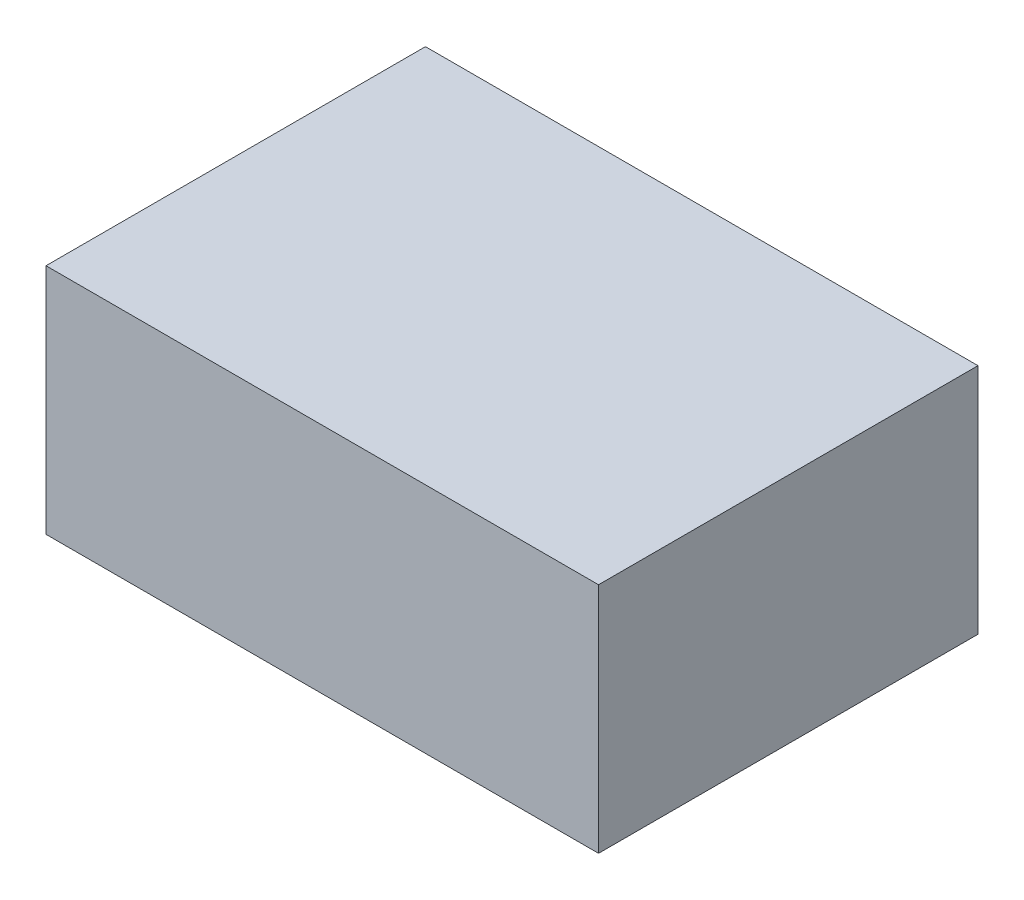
from build123d import *

# Parameters (mm, degrees)
SKETCH1_W      = 92.631552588
SKETCH1_H      = 63.616611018
EXTRUDE1_DEPTH = 39


with BuildPart() as part:
    # Sketch1 → Extrude1 (new body)
    with BuildSketch(Plane(origin=(0, 0, 0), x_dir=(1, 0, 0), z_dir=(0, 1, 0))):
        with Locations((46.315776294, -31.808305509)):
            Rectangle(SKETCH1_W, SKETCH1_H)
    extrude(amount=EXTRUDE1_DEPTH)


solid = part.part
